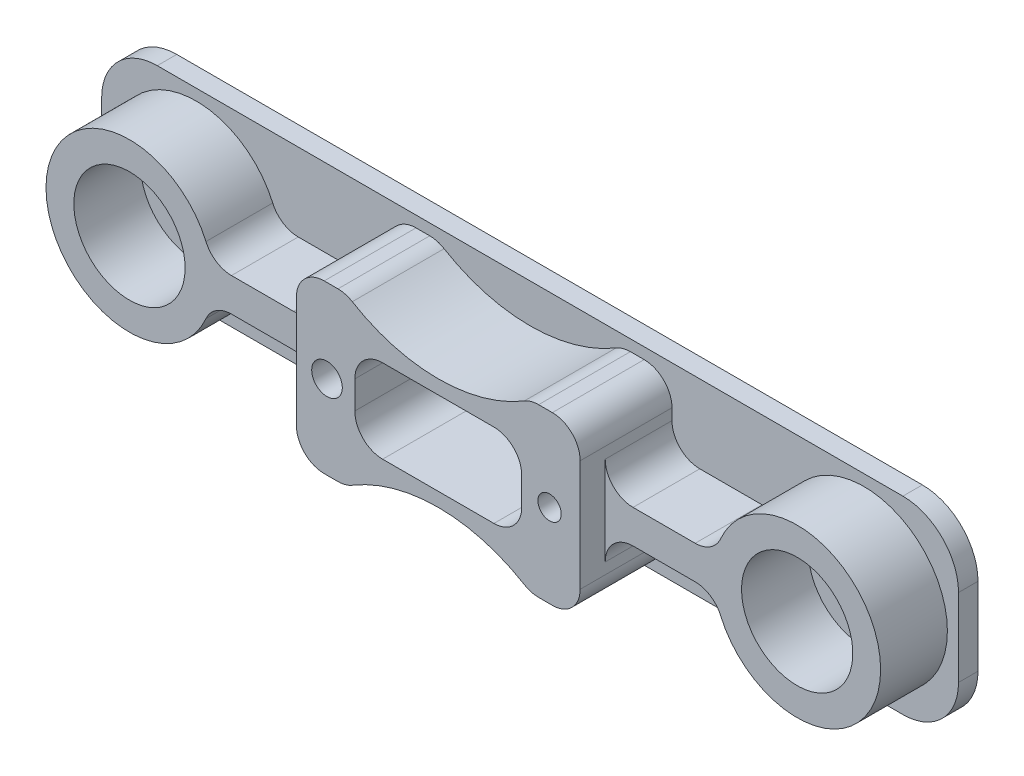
from build123d import *

# Parameters (mm, degrees)
AUFSATZ_LINEAR_AUSTRAGEN1_DEPTH = 3.5
SKIZZE2_R                       = 10
AUFSATZ_LINEAR_AUSTRAGEN2_DEPTH = 12
AUFSATZ_LINEAR_AUSTRAGEN3_DEPTH = 16.5
SKIZZE4_W                       = 30
SKIZZE4_H                       = 15
SCHNITT_LINEAR_AUSTRAGEN1_DEPTH = 16.5
VERRUNDUNG1_R                   = 5
M5_GEWINDEBOHRUNG1_D            = 4.2
M5_GEWINDEBOHRUNG1_DEPTH        = 17
M5_GEWINDEBOHRUNG1_TIP          = 1.2618073


with BuildPart() as part:
    # Skizze1 → Aufsatz-Linear austragen1 (new body)
    with BuildSketch(Plane.XY):
        with BuildLine():
            Line((-67, -17), (67, -17))
            ThreePointArc((67, -17), (74.071067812, -14.071067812), (77, -7))
            Line((77, -7), (77, 7))
            ThreePointArc((77, 7), (74.071067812, 14.071067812), (67, 17))
            Line((67, 17), (-67, 17))
            ThreePointArc((-67, 17), (-74.071067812, 14.071067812), (-77, 7))
            Line((-77, 7), (-77, -7))
            ThreePointArc((-77, -7), (-74.071067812, -14.071067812), (-67, -17))
        make_face()
    extrude(amount=AUFSATZ_LINEAR_AUSTRAGEN1_DEPTH)

    # Skizze2 → Aufsatz-Linear austragen2 (add)
    with BuildSketch(Plane.XY.offset(3.5)):
        with BuildLine():
            Line((-45.303061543, 3), (45.303061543, 3))
            ThreePointArc((45.303061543, 3), (75, 0), (45.303061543, -3))
            Line((45.303061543, -3), (-45.303061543, -3))
            ThreePointArc((-45.303061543, -3), (-75, 0), (-45.303061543, 3))
        make_face()
        with Locations((-60, 0)):
            Circle(SKIZZE2_R, mode=Mode.SUBTRACT)
        with Locations(Location((60, 0, 0), (0, 0, 180))):
            Circle(SKIZZE2_R, mode=Mode.SUBTRACT)
    extrude(amount=AUFSATZ_LINEAR_AUSTRAGEN2_DEPTH)

    # Skizze3 → Aufsatz-Linear austragen3 (add)
    with BuildSketch(Plane.XY.offset(3.5)):
        with BuildLine():
            Line((-25.5, 15), (-25.5, -15))
            Line((-25.5, -15), (-16.583123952, -15))
            ThreePointArc((-16.583123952, -15), (0, -10), (16.583123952, -15))
            Line((16.583123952, -15), (25.5, -15))
            Line((25.5, -15), (25.5, 15))
            Line((25.5, 15), (16.583123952, 15))
            ThreePointArc((16.583123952, 15), (0, 10), (-16.583123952, 15))
            Line((-16.583123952, 15), (-25.5, 15))
        make_face()
    extrude(amount=AUFSATZ_LINEAR_AUSTRAGEN3_DEPTH)

    # Skizze4 → Schnitt-Linear austragen1 (cut)
    with BuildSketch(Plane.XY.offset(20)):
        Rectangle(SKIZZE4_W, SKIZZE4_H)
    extrude(amount=-SCHNITT_LINEAR_AUSTRAGEN1_DEPTH, mode=Mode.SUBTRACT)

    # Verrundung1
    verrundung1_edges = [part.edges().sort_by_distance(p)[0] for p in [
        (-45.303061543, 3, 9.5),
        (-45.303061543, -3, 9.5),
        (45.303061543, -3, 9.5),
        (45.303061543, 3, 9.5),
        (25.5, 3, 9.5),
        (-25.5, 3, 9.5),
        (-25.5, -3, 9.5),
        (-25.5, 15, 11.75),
        (25.5, -3, 9.5),
        (25.5, -15, 11.75),
        (-16.583123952, 15, 11.75),
        (16.583123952, 15, 11.75),
        (25.5, 15, 11.75),
        (16.583123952, -15, 11.75),
        (-16.583123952, -15, 11.75),
        (-25.5, -15, 11.75),
        (15, 7.5, 11.75),
        (15, -7.5, 11.75),
        (-15, -7.5, 11.75),
        (-15, 7.5, 11.75),
    ]]
    fillet(verrundung1_edges, radius=VERRUNDUNG1_R)

    # M5 Gewindebohrung1
    with Locations(Plane.XY.offset(20)):
        with Locations((20, 0)):
            Hole(M5_GEWINDEBOHRUNG1_D / 2, depth=M5_GEWINDEBOHRUNG1_DEPTH)
            with Locations((0, 0, -(M5_GEWINDEBOHRUNG1_DEPTH + M5_GEWINDEBOHRUNG1_TIP / 2))):  # 118° drill point
                Cone(0, M5_GEWINDEBOHRUNG1_D / 2, M5_GEWINDEBOHRUNG1_TIP, mode=Mode.SUBTRACT)

    # Skizze7 → Formsenkung f_r M5 Senkschraube mit Inne (revolve, cut)
    with BuildSketch(Plane.YZ.offset(-20)):
        Polygon((0, 0), (0, 20), (2.75, 20), (2.75, 2.95), (5.2, 0.5), (5.2, 0), align=None)
    revolve(axis=Axis((-20, 0, -6.35), (0, 0, 1)), mode=Mode.SUBTRACT)


solid = part.part
